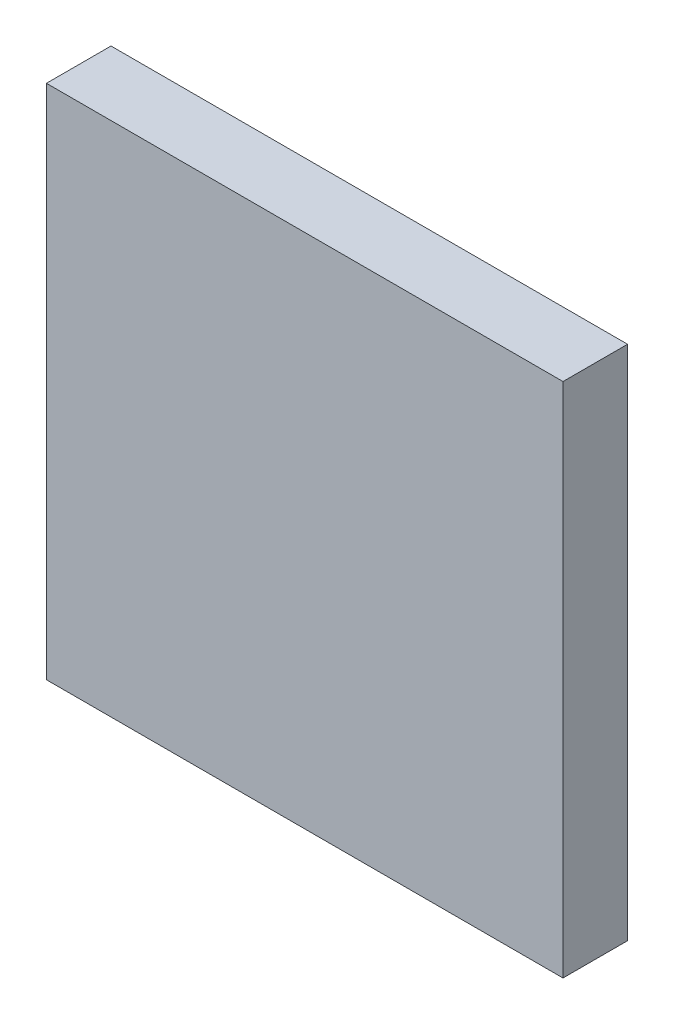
from build123d import *

# Parameters (mm, degrees)
SKETCH1_W       = 19.05
SKETCH1_H       = 152.4
BASEPLATE_DEPTH = 76.2


with BuildPart() as part:
    # Sketch1 → BasePlate (new, symmetric)
    with BuildSketch(Plane(origin=(0, 0, 0), x_dir=(0, 0, -1), z_dir=(1, 0, 0))):
        Rectangle(SKETCH1_W, SKETCH1_H)
    extrude(amount=BASEPLATE_DEPTH, both=True)


solid = part.part
